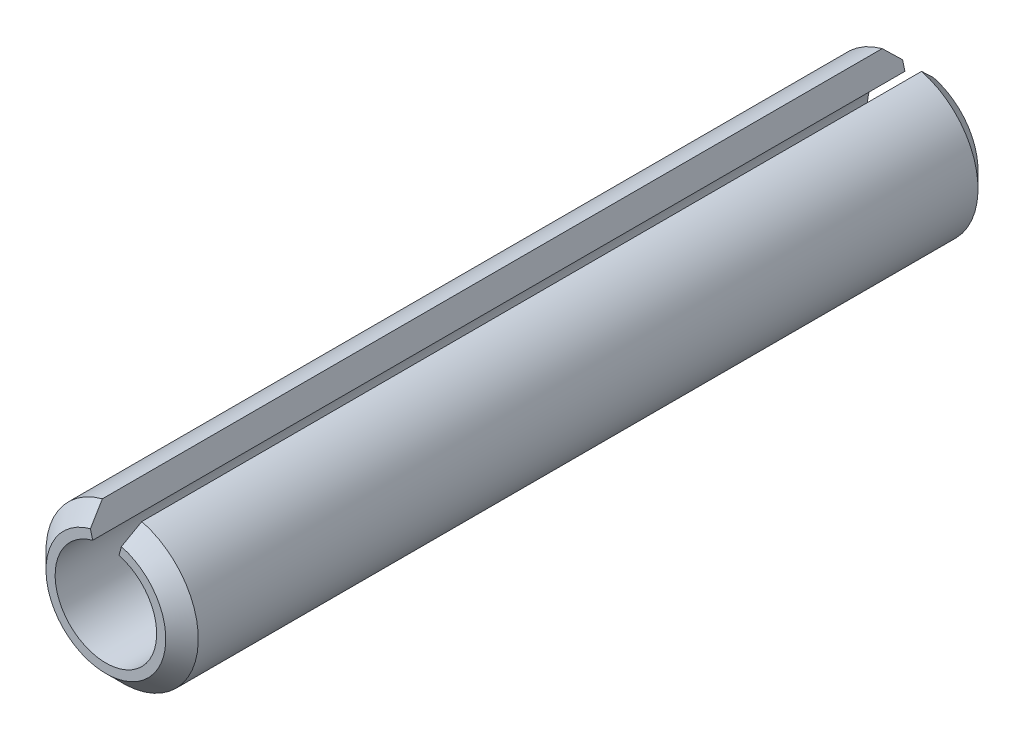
from build123d import *

# Parameters (mm, degrees)
EXTRUDE1_DEPTH = 6.35
CHAMFER1_SIZE  = 0.254


with BuildPart() as part:
    # Sketch1 → Extrude1 (new, symmetric)
    with BuildSketch(Plane.XY):
        with BuildLine():
            Line((0.205437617, 0.766703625), (0.308156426, 1.150055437))
            ThreePointArc((0.308156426, 1.150055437), (0, -1.190625), (-0.308156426, 1.150055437))
            Line((-0.308156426, 1.150055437), (-0.205437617, 0.766703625))
            ThreePointArc((-0.205437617, 0.766703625), (0, -0.79375), (0.205437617, 0.766703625))
        make_face()
    extrude(amount=EXTRUDE1_DEPTH, both=True)

    # Chamfer1
    chamfer1_edges = [part.edges().sort_by_distance(p)[0] for p in [
        (0, -1.190625, 6.35),
        (0, -1.190625, -6.35),
    ]]
    chamfer(chamfer1_edges, length=CHAMFER1_SIZE)


solid = part.part
